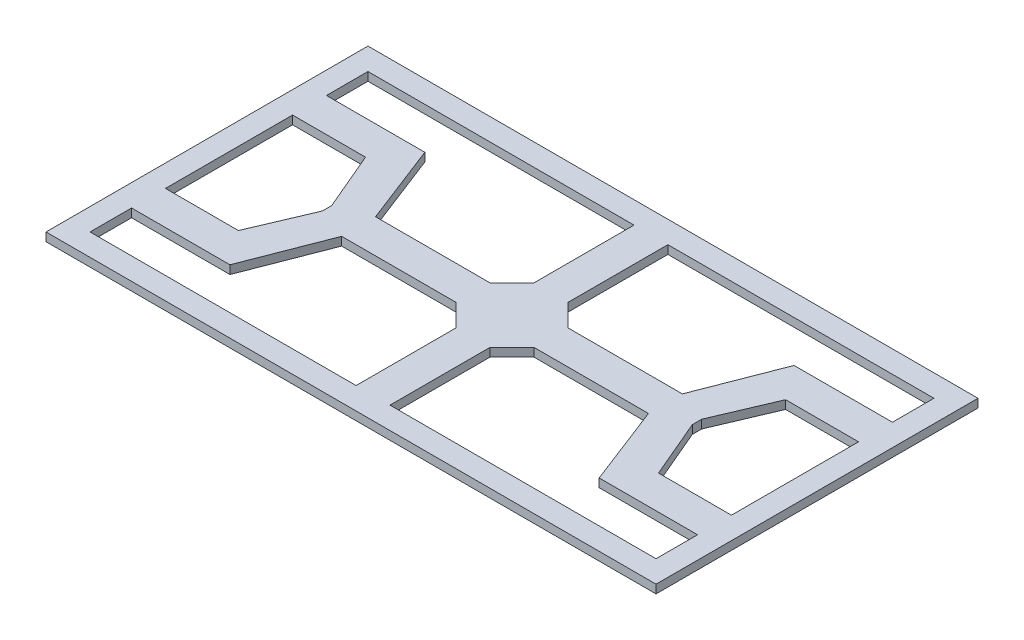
from build123d import *

# Parameters (mm, degrees)
SKETCH2_W           = 914.4
SKETCH2_H           = 482.6
BOSS_EXTRUDE1_DEPTH = 12.7


with BuildPart() as part:
    # Sketch2 → Boss-Extrude1 (new body)
    with BuildSketch(Plane(origin=(0, 0, 0), x_dir=(1, 0, 0), z_dir=(0, 1, 0))):
        Rectangle(SKETCH2_W, SKETCH2_H)
        Polygon((-25.4, 58.198711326), (-58.198711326, 25.4), (-229.948625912, 25.4), (-276.726315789, 146.05), (-424.18, 146.05), (-424.18, 208.28), (-25.4, 208.28), align=None, mode=Mode.SUBTRACT)
        Polygon((-58.198711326, -25.4), (-25.4, -58.198711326), (-25.4, -208.28), (-424.18, -208.28), (-424.18, -146.05), (-276.726315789, -146.05), (-229.948625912, -25.4), align=None, mode=Mode.SUBTRACT)
        Polygon((25.4, -58.198711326), (58.198711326, -25.4), (229.948625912, -25.4), (276.726315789, -146.05), (424.18, -146.05), (424.18, -208.28), (25.4, -208.28), align=None, mode=Mode.SUBTRACT)
        Polygon((58.198711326, 25.4), (25.4, 58.198711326), (25.4, 208.28), (424.18, 208.28), (424.18, 146.05), (276.726315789, 146.05), (229.948625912, 25.4), align=None, mode=Mode.SUBTRACT)
        Polygon((-424.18, -95.25), (-424.18, 95.25), (-314.826315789, 95.25), (-277.313237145, 7.036078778), (-277.313237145, -7.036078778), (-314.826315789, -95.25), align=None, mode=Mode.SUBTRACT)
        Polygon((277.313237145, -7.036078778), (277.313237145, 7.036078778), (314.826315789, 95.25), (424.18, 95.25), (424.18, -95.25), (314.826315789, -95.25), align=None, mode=Mode.SUBTRACT)
    extrude(amount=BOSS_EXTRUDE1_DEPTH)


solid = part.part
